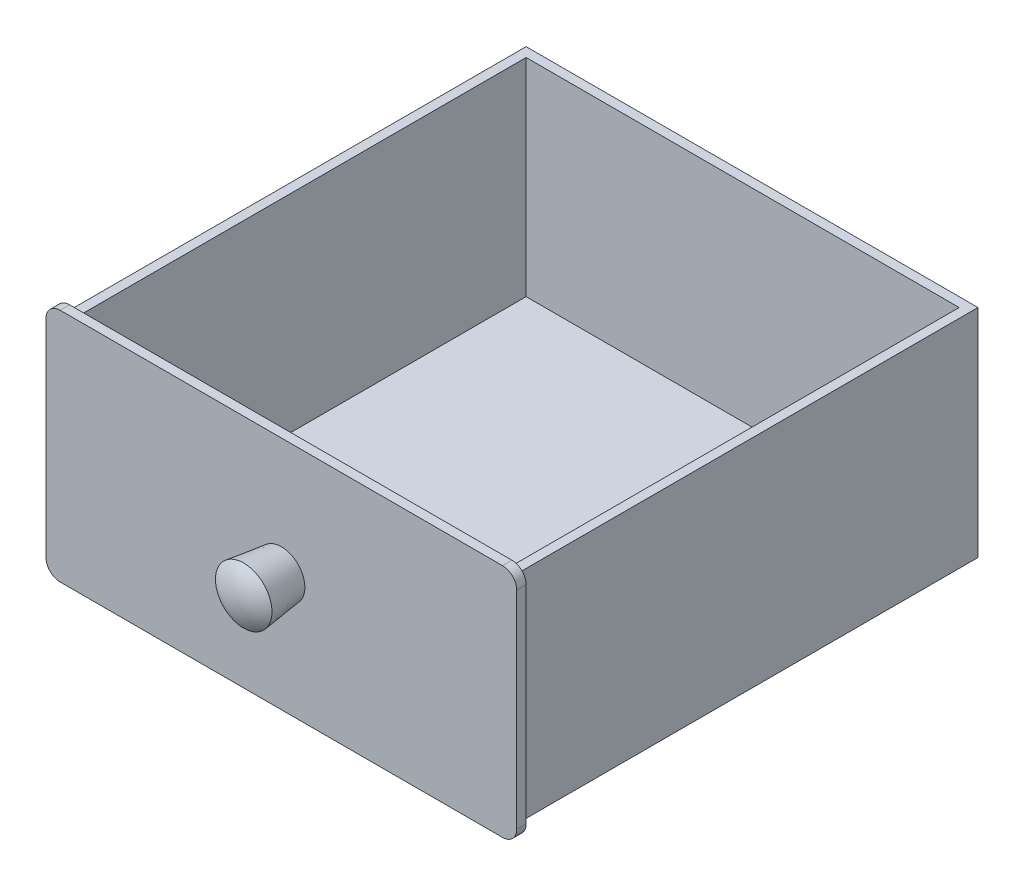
ISO-10303-21;
HEADER;
FILE_DESCRIPTION(('STEP AP214'),'2;1');
FILE_NAME('part.step','',(''),(''),'','','');
FILE_SCHEMA(('AUTOMOTIVE_DESIGN { 1 0 10303 214 1 1 1 1 }'));
ENDSEC;
DATA;
#1=APPLICATION_CONTEXT('core data for automotive mechanical design processes');
#2=APPLICATION_PROTOCOL_DEFINITION('international standard','automotive_design',2000,#1);
#3=PRODUCT_CONTEXT('',#1,'mechanical');
#4=PRODUCT('Part','Part','',(#3));
#5=PRODUCT_RELATED_PRODUCT_CATEGORY('part','',(#4));
#6=PRODUCT_DEFINITION_FORMATION('','',#4);
#7=PRODUCT_DEFINITION_CONTEXT('part definition',#1,'design');
#8=PRODUCT_DEFINITION('design','',#6,#7);
#9=PRODUCT_DEFINITION_SHAPE('','',#8);
#10=(LENGTH_UNIT() NAMED_UNIT(*) SI_UNIT(.MILLI.,.METRE.));
#11=(NAMED_UNIT(*) PLANE_ANGLE_UNIT() SI_UNIT($,.RADIAN.));
#12=(NAMED_UNIT(*) SI_UNIT($,.STERADIAN.) SOLID_ANGLE_UNIT());
#13=UNCERTAINTY_MEASURE_WITH_UNIT(LENGTH_MEASURE(1.E-05),#10,'distance_accuracy_value','');
#14=(GEOMETRIC_REPRESENTATION_CONTEXT(3) GLOBAL_UNCERTAINTY_ASSIGNED_CONTEXT((#13)) GLOBAL_UNIT_ASSIGNED_CONTEXT((#10,
#11,#12)) REPRESENTATION_CONTEXT('',''));
#15=CARTESIAN_POINT('',(0.,0.,0.));
#16=DIRECTION('',(0.,0.,1.));
#17=DIRECTION('',(1.,0.,0.));
#18=AXIS2_PLACEMENT_3D('',#15,#16,#17);
#19=CARTESIAN_POINT('',(0.,46.,0.));
#20=DIRECTION('',(0.,-1.,0.));
#21=DIRECTION('',(0.,0.,-1.));
#22=AXIS2_PLACEMENT_3D('',#19,#20,#21);
#23=PLANE('',#22);
#24=DIRECTION('',(0.,0.,-1.));
#25=VECTOR('',#24,1.);
#26=CARTESIAN_POINT('',(46.,46.,0.));
#27=LINE('',#26,#25);
#28=CARTESIAN_POINT('',(46.,46.,49.));
#29=VERTEX_POINT('',#28);
#30=CARTESIAN_POINT('',(46.,46.,-47.));
#31=VERTEX_POINT('',#30);
#32=EDGE_CURVE('E158',#29,#31,#27,.T.);
#33=ORIENTED_EDGE('',*,*,#32,.F.);
#34=DIRECTION('',(1.,0.,0.));
#35=VECTOR('',#34,1.);
#36=CARTESIAN_POINT('',(-48.,46.,49.));
#37=LINE('',#36,#35);
#38=CARTESIAN_POINT('',(48.,46.,49.));
#39=VERTEX_POINT('',#38);
#40=EDGE_CURVE('E188',#29,#39,#37,.T.);
#41=ORIENTED_EDGE('',*,*,#40,.T.);
#42=DIRECTION('',(0.,0.,-1.));
#43=VECTOR('',#42,1.);
#44=CARTESIAN_POINT('',(48.,46.,49.));
#45=LINE('',#44,#43);
#46=CARTESIAN_POINT('',(48.,46.,-49.));
#47=VERTEX_POINT('',#46);
#48=EDGE_CURVE('E179',#39,#47,#45,.T.);
#49=ORIENTED_EDGE('',*,*,#48,.T.);
#50=DIRECTION('',(-1.,0.,0.));
#51=VECTOR('',#50,1.);
#52=CARTESIAN_POINT('',(-48.,46.,-49.));
#53=LINE('',#52,#51);
#54=CARTESIAN_POINT('',(-48.,46.,-49.));
#55=VERTEX_POINT('',#54);
#56=EDGE_CURVE('E182',#47,#55,#53,.T.);
#57=ORIENTED_EDGE('',*,*,#56,.T.);
#58=DIRECTION('',(0.,0.,1.));
#59=VECTOR('',#58,1.);
#60=CARTESIAN_POINT('',(-48.,46.,49.));
#61=LINE('',#60,#59);
#62=CARTESIAN_POINT('',(-48.,46.,49.));
#63=VERTEX_POINT('',#62);
#64=EDGE_CURVE('E185',#55,#63,#61,.T.);
#65=ORIENTED_EDGE('',*,*,#64,.T.);
#66=CARTESIAN_POINT('',(-46.,46.,49.));
#67=VERTEX_POINT('',#66);
#68=EDGE_CURVE('E189',#63,#67,#37,.T.);
#69=ORIENTED_EDGE('',*,*,#68,.T.);
#70=DIRECTION('',(0.,0.,1.));
#71=VECTOR('',#70,1.);
#72=CARTESIAN_POINT('',(-46.,46.,0.));
#73=LINE('',#72,#71);
#74=CARTESIAN_POINT('',(-46.,46.,-47.));
#75=VERTEX_POINT('',#74);
#76=EDGE_CURVE('E169',#75,#67,#73,.T.);
#77=ORIENTED_EDGE('',*,*,#76,.F.);
#78=DIRECTION('',(-1.,0.,0.));
#79=VECTOR('',#78,1.);
#80=CARTESIAN_POINT('',(0.,46.,-47.));
#81=LINE('',#80,#79);
#82=EDGE_CURVE('E277',#31,#75,#81,.T.);
#83=ORIENTED_EDGE('',*,*,#82,.F.);
#84=EDGE_LOOP('',(#33,#41,#49,#57,#65,#69,#77,#83));
#85=FACE_BOUND('',#84,.T.);
#86=ADVANCED_FACE('F32',(#85),#23,.F.);
#87=CARTESIAN_POINT('',(48.,46.,49.));
#88=DIRECTION('',(-1.,0.,0.));
#89=DIRECTION('',(0.,0.,1.));
#90=AXIS2_PLACEMENT_3D('',#87,#88,#89);
#91=PLANE('',#90);
#92=DIRECTION('',(0.,0.,-1.));
#93=VECTOR('',#92,1.);
#94=CARTESIAN_POINT('',(48.,0.,49.));
#95=LINE('',#94,#93);
#96=CARTESIAN_POINT('',(48.,0.,49.));
#97=VERTEX_POINT('',#96);
#98=CARTESIAN_POINT('',(48.,0.,-49.));
#99=VERTEX_POINT('',#98);
#100=EDGE_CURVE('E192',#97,#99,#95,.T.);
#101=ORIENTED_EDGE('',*,*,#100,.T.);
#102=DIRECTION('',(0.,-1.,0.));
#103=VECTOR('',#102,1.);
#104=CARTESIAN_POINT('',(48.,46.,-49.));
#105=LINE('',#104,#103);
#106=EDGE_CURVE('E208',#47,#99,#105,.T.);
#107=ORIENTED_EDGE('',*,*,#106,.F.);
#108=ORIENTED_EDGE('',*,*,#48,.F.);
#109=DIRECTION('',(0.,-1.,0.));
#110=VECTOR('',#109,1.);
#111=CARTESIAN_POINT('',(48.,46.,49.));
#112=LINE('',#111,#110);
#113=EDGE_CURVE('E191',#39,#97,#112,.T.);
#114=ORIENTED_EDGE('',*,*,#113,.T.);
#115=EDGE_LOOP('',(#101,#107,#108,#114));
#116=FACE_BOUND('',#115,.T.);
#117=ADVANCED_FACE('F297',(#116),#91,.F.);
#118=CARTESIAN_POINT('',(-48.,46.,-49.));
#119=DIRECTION('',(0.,0.,1.));
#120=DIRECTION('',(1.,0.,0.));
#121=AXIS2_PLACEMENT_3D('',#118,#119,#120);
#122=PLANE('',#121);
#123=DIRECTION('',(-1.,0.,0.));
#124=VECTOR('',#123,1.);
#125=CARTESIAN_POINT('',(-48.,0.,-49.));
#126=LINE('',#125,#124);
#127=CARTESIAN_POINT('',(-48.,0.,-49.));
#128=VERTEX_POINT('',#127);
#129=EDGE_CURVE('E195',#99,#128,#126,.T.);
#130=ORIENTED_EDGE('',*,*,#129,.T.);
#131=DIRECTION('',(0.,-1.,0.));
#132=VECTOR('',#131,1.);
#133=CARTESIAN_POINT('',(-48.,46.,-49.));
#134=LINE('',#133,#132);
#135=EDGE_CURVE('E205',#55,#128,#134,.T.);
#136=ORIENTED_EDGE('',*,*,#135,.F.);
#137=ORIENTED_EDGE('',*,*,#56,.F.);
#138=ORIENTED_EDGE('',*,*,#106,.T.);
#139=EDGE_LOOP('',(#130,#136,#137,#138));
#140=FACE_BOUND('',#139,.T.);
#141=ADVANCED_FACE('F316',(#140),#122,.F.);
#142=CARTESIAN_POINT('',(-48.,46.,49.));
#143=DIRECTION('',(1.,0.,0.));
#144=DIRECTION('',(0.,0.,-1.));
#145=AXIS2_PLACEMENT_3D('',#142,#143,#144);
#146=PLANE('',#145);
#147=DIRECTION('',(0.,0.,1.));
#148=VECTOR('',#147,1.);
#149=CARTESIAN_POINT('',(-48.,0.,49.));
#150=LINE('',#149,#148);
#151=CARTESIAN_POINT('',(-48.,0.,49.));
#152=VERTEX_POINT('',#151);
#153=EDGE_CURVE('E197',#128,#152,#150,.T.);
#154=ORIENTED_EDGE('',*,*,#153,.T.);
#155=DIRECTION('',(0.,-1.,0.));
#156=VECTOR('',#155,1.);
#157=CARTESIAN_POINT('',(-48.,46.,49.));
#158=LINE('',#157,#156);
#159=EDGE_CURVE('E203',#63,#152,#158,.T.);
#160=ORIENTED_EDGE('',*,*,#159,.F.);
#161=ORIENTED_EDGE('',*,*,#64,.F.);
#162=ORIENTED_EDGE('',*,*,#135,.T.);
#163=EDGE_LOOP('',(#154,#160,#161,#162));
#164=FACE_BOUND('',#163,.T.);
#165=ADVANCED_FACE('F290',(#164),#146,.F.);
#166=CARTESIAN_POINT('',(0.,0.,0.));
#167=DIRECTION('',(0.,-1.,0.));
#168=DIRECTION('',(0.,0.,-1.));
#169=AXIS2_PLACEMENT_3D('',#166,#167,#168);
#170=PLANE('',#169);
#171=ORIENTED_EDGE('',*,*,#100,.F.);
#172=DIRECTION('',(1.,0.,0.));
#173=VECTOR('',#172,1.);
#174=CARTESIAN_POINT('',(-48.,0.,49.));
#175=LINE('',#174,#173);
#176=EDGE_CURVE('E183',#152,#97,#175,.T.);
#177=ORIENTED_EDGE('',*,*,#176,.F.);
#178=ORIENTED_EDGE('',*,*,#153,.F.);
#179=ORIENTED_EDGE('',*,*,#129,.F.);
#180=EDGE_LOOP('',(#171,#177,#178,#179));
#181=FACE_BOUND('',#180,.T.);
#182=ADVANCED_FACE('F294',(#181),#170,.T.);
#183=CARTESIAN_POINT('',(46.,46.,49.));
#184=DIRECTION('',(-1.,0.,0.));
#185=DIRECTION('',(0.,0.,1.));
#186=AXIS2_PLACEMENT_3D('',#183,#184,#185);
#187=PLANE('',#186);
#188=DIRECTION('',(0.,0.,-1.));
#189=VECTOR('',#188,1.);
#190=CARTESIAN_POINT('',(46.,2.,0.));
#191=LINE('',#190,#189);
#192=CARTESIAN_POINT('',(46.,2.,49.));
#193=VERTEX_POINT('',#192);
#194=CARTESIAN_POINT('',(46.,2.,-47.));
#195=VERTEX_POINT('',#194);
#196=EDGE_CURVE('E272',#193,#195,#191,.T.);
#197=ORIENTED_EDGE('',*,*,#196,.F.);
#198=DIRECTION('',(0.,-1.,0.));
#199=VECTOR('',#198,1.);
#200=CARTESIAN_POINT('',(46.,46.,49.));
#201=LINE('',#200,#199);
#202=EDGE_CURVE('E154',#29,#193,#201,.T.);
#203=ORIENTED_EDGE('',*,*,#202,.F.);
#204=ORIENTED_EDGE('',*,*,#32,.T.);
#205=DIRECTION('',(0.,-1.,0.));
#206=VECTOR('',#205,1.);
#207=CARTESIAN_POINT('',(46.,46.,-47.));
#208=LINE('',#207,#206);
#209=EDGE_CURVE('E173',#31,#195,#208,.T.);
#210=ORIENTED_EDGE('',*,*,#209,.T.);
#211=EDGE_LOOP('',(#197,#203,#204,#210));
#212=FACE_BOUND('',#211,.T.);
#213=ADVANCED_FACE('F301',(#212),#187,.T.);
#214=CARTESIAN_POINT('',(-48.,46.,-47.));
#215=DIRECTION('',(0.,0.,1.));
#216=DIRECTION('',(1.,0.,0.));
#217=AXIS2_PLACEMENT_3D('',#214,#215,#216);
#218=PLANE('',#217);
#219=DIRECTION('',(-1.,0.,0.));
#220=VECTOR('',#219,1.);
#221=CARTESIAN_POINT('',(0.,2.,-47.));
#222=LINE('',#221,#220);
#223=CARTESIAN_POINT('',(-46.,2.,-47.));
#224=VERTEX_POINT('',#223);
#225=EDGE_CURVE('E163',#195,#224,#222,.T.);
#226=ORIENTED_EDGE('',*,*,#225,.F.);
#227=ORIENTED_EDGE('',*,*,#209,.F.);
#228=ORIENTED_EDGE('',*,*,#82,.T.);
#229=DIRECTION('',(0.,-1.,0.));
#230=VECTOR('',#229,1.);
#231=CARTESIAN_POINT('',(-46.,46.,-47.));
#232=LINE('',#231,#230);
#233=EDGE_CURVE('E171',#75,#224,#232,.T.);
#234=ORIENTED_EDGE('',*,*,#233,.T.);
#235=EDGE_LOOP('',(#226,#227,#228,#234));
#236=FACE_BOUND('',#235,.T.);
#237=ADVANCED_FACE('F282',(#236),#218,.T.);
#238=CARTESIAN_POINT('',(-46.,46.,49.));
#239=DIRECTION('',(1.,0.,0.));
#240=DIRECTION('',(0.,0.,-1.));
#241=AXIS2_PLACEMENT_3D('',#238,#239,#240);
#242=PLANE('',#241);
#243=DIRECTION('',(0.,0.,1.));
#244=VECTOR('',#243,1.);
#245=CARTESIAN_POINT('',(-46.,2.,0.));
#246=LINE('',#245,#244);
#247=CARTESIAN_POINT('',(-46.,2.,49.));
#248=VERTEX_POINT('',#247);
#249=EDGE_CURVE('E159',#224,#248,#246,.T.);
#250=ORIENTED_EDGE('',*,*,#249,.F.);
#251=ORIENTED_EDGE('',*,*,#233,.F.);
#252=ORIENTED_EDGE('',*,*,#76,.T.);
#253=DIRECTION('',(0.,-1.,0.));
#254=VECTOR('',#253,1.);
#255=CARTESIAN_POINT('',(-46.,46.,49.));
#256=LINE('',#255,#254);
#257=EDGE_CURVE('E151',#67,#248,#256,.T.);
#258=ORIENTED_EDGE('',*,*,#257,.T.);
#259=EDGE_LOOP('',(#250,#251,#252,#258));
#260=FACE_BOUND('',#259,.T.);
#261=ADVANCED_FACE('F167',(#260),#242,.T.);
#262=CARTESIAN_POINT('',(0.,2.,0.));
#263=DIRECTION('',(0.,-1.,0.));
#264=DIRECTION('',(0.,0.,-1.));
#265=AXIS2_PLACEMENT_3D('',#262,#263,#264);
#266=PLANE('',#265);
#267=ORIENTED_EDGE('',*,*,#196,.T.);
#268=ORIENTED_EDGE('',*,*,#225,.T.);
#269=ORIENTED_EDGE('',*,*,#249,.T.);
#270=DIRECTION('',(1.,0.,0.));
#271=VECTOR('',#270,1.);
#272=CARTESIAN_POINT('',(0.,2.,49.));
#273=LINE('',#272,#271);
#274=EDGE_CURVE('E146',#248,#193,#273,.T.);
#275=ORIENTED_EDGE('',*,*,#274,.T.);
#276=EDGE_LOOP('',(#267,#268,#269,#275));
#277=FACE_BOUND('',#276,.T.);
#278=ADVANCED_FACE('F162',(#277),#266,.F.);
#279=CARTESIAN_POINT('',(-50.,48.,51.));
#280=DIRECTION('',(1.,0.,0.));
#281=DIRECTION('',(0.,1.,0.));
#282=AXIS2_PLACEMENT_3D('',#279,#280,#281);
#283=PLANE('',#282);
#284=DIRECTION('',(0.,-1.,0.));
#285=VECTOR('',#284,1.);
#286=CARTESIAN_POINT('',(-50.,48.,49.));
#287=LINE('',#286,#285);
#288=CARTESIAN_POINT('',(-50.,45.,49.));
#289=VERTEX_POINT('',#288);
#290=CARTESIAN_POINT('',(-50.,1.,49.));
#291=VERTEX_POINT('',#290);
#292=EDGE_CURVE('E346',#289,#291,#287,.T.);
#293=ORIENTED_EDGE('',*,*,#292,.T.);
#294=DIRECTION('',(0.,0.,-1.));
#295=VECTOR('',#294,1.);
#296=CARTESIAN_POINT('',(-50.,1.,51.));
#297=LINE('',#296,#295);
#298=CARTESIAN_POINT('',(-50.,1.,51.));
#299=VERTEX_POINT('',#298);
#300=EDGE_CURVE('E230',#291,#299,#297,.F.);
#301=ORIENTED_EDGE('',*,*,#300,.T.);
#302=DIRECTION('',(0.,-1.,0.));
#303=VECTOR('',#302,1.);
#304=CARTESIAN_POINT('',(-50.,48.,51.));
#305=LINE('',#304,#303);
#306=CARTESIAN_POINT('',(-50.,45.,51.));
#307=VERTEX_POINT('',#306);
#308=EDGE_CURVE('E265',#307,#299,#305,.T.);
#309=ORIENTED_EDGE('',*,*,#308,.F.);
#310=DIRECTION('',(0.,0.,-1.));
#311=VECTOR('',#310,1.);
#312=CARTESIAN_POINT('',(-50.,45.,51.));
#313=LINE('',#312,#311);
#314=EDGE_CURVE('E227',#307,#289,#313,.T.);
#315=ORIENTED_EDGE('',*,*,#314,.T.);
#316=EDGE_LOOP('',(#293,#301,#309,#315));
#317=FACE_BOUND('',#316,.T.);
#318=ADVANCED_FACE('F376',(#317),#283,.F.);
#319=CARTESIAN_POINT('',(-50.,-2.,51.));
#320=DIRECTION('',(0.,1.,0.));
#321=DIRECTION('',(-1.,0.,0.));
#322=AXIS2_PLACEMENT_3D('',#319,#320,#321);
#323=PLANE('',#322);
#324=DIRECTION('',(1.,0.,0.));
#325=VECTOR('',#324,1.);
#326=CARTESIAN_POINT('',(-50.,-2.,51.));
#327=LINE('',#326,#325);
#328=CARTESIAN_POINT('',(-47.,-2.,51.));
#329=VERTEX_POINT('',#328);
#330=CARTESIAN_POINT('',(47.,-2.,51.));
#331=VERTEX_POINT('',#330);
#332=EDGE_CURVE('E257',#329,#331,#327,.T.);
#333=ORIENTED_EDGE('',*,*,#332,.F.);
#334=DIRECTION('',(0.,0.,-1.));
#335=VECTOR('',#334,1.);
#336=CARTESIAN_POINT('',(-47.,-2.,51.));
#337=LINE('',#336,#335);
#338=CARTESIAN_POINT('',(-47.,-2.,49.));
#339=VERTEX_POINT('',#338);
#340=EDGE_CURVE('E216',#329,#339,#337,.T.);
#341=ORIENTED_EDGE('',*,*,#340,.T.);
#342=DIRECTION('',(1.,0.,0.));
#343=VECTOR('',#342,1.);
#344=CARTESIAN_POINT('',(-50.,-2.,49.));
#345=LINE('',#344,#343);
#346=CARTESIAN_POINT('',(47.,-2.,49.));
#347=VERTEX_POINT('',#346);
#348=EDGE_CURVE('E268',#339,#347,#345,.T.);
#349=ORIENTED_EDGE('',*,*,#348,.T.);
#350=DIRECTION('',(0.,0.,-1.));
#351=VECTOR('',#350,1.);
#352=CARTESIAN_POINT('',(47.,-2.,51.));
#353=LINE('',#352,#351);
#354=EDGE_CURVE('E214',#347,#331,#353,.F.);
#355=ORIENTED_EDGE('',*,*,#354,.T.);
#356=EDGE_LOOP('',(#333,#341,#349,#355));
#357=FACE_BOUND('',#356,.T.);
#358=ADVANCED_FACE('F344',(#357),#323,.F.);
#359=CARTESIAN_POINT('',(50.,48.,51.));
#360=DIRECTION('',(-1.,0.,0.));
#361=DIRECTION('',(0.,-1.,0.));
#362=AXIS2_PLACEMENT_3D('',#359,#360,#361);
#363=PLANE('',#362);
#364=DIRECTION('',(0.,1.,0.));
#365=VECTOR('',#364,1.);
#366=CARTESIAN_POINT('',(50.,48.,51.));
#367=LINE('',#366,#365);
#368=CARTESIAN_POINT('',(50.,1.,51.));
#369=VERTEX_POINT('',#368);
#370=CARTESIAN_POINT('',(50.,45.,51.));
#371=VERTEX_POINT('',#370);
#372=EDGE_CURVE('E247',#369,#371,#367,.T.);
#373=ORIENTED_EDGE('',*,*,#372,.F.);
#374=DIRECTION('',(0.,0.,-1.));
#375=VECTOR('',#374,1.);
#376=CARTESIAN_POINT('',(50.,1.,51.));
#377=LINE('',#376,#375);
#378=CARTESIAN_POINT('',(50.,1.,49.));
#379=VERTEX_POINT('',#378);
#380=EDGE_CURVE('E11',#369,#379,#377,.T.);
#381=ORIENTED_EDGE('',*,*,#380,.T.);
#382=DIRECTION('',(0.,1.,0.));
#383=VECTOR('',#382,1.);
#384=CARTESIAN_POINT('',(50.,48.,49.));
#385=LINE('',#384,#383);
#386=CARTESIAN_POINT('',(50.,45.,49.));
#387=VERTEX_POINT('',#386);
#388=EDGE_CURVE('E250',#379,#387,#385,.T.);
#389=ORIENTED_EDGE('',*,*,#388,.T.);
#390=DIRECTION('',(0.,0.,-1.));
#391=VECTOR('',#390,1.);
#392=CARTESIAN_POINT('',(50.,45.,51.));
#393=LINE('',#392,#391);
#394=EDGE_CURVE('E40',#387,#371,#393,.F.);
#395=ORIENTED_EDGE('',*,*,#394,.T.);
#396=EDGE_LOOP('',(#373,#381,#389,#395));
#397=FACE_BOUND('',#396,.T.);
#398=ADVANCED_FACE('F246',(#397),#363,.F.);
#399=CARTESIAN_POINT('',(-50.,48.,51.));
#400=DIRECTION('',(0.,-1.,0.));
#401=DIRECTION('',(0.,0.,-1.));
#402=AXIS2_PLACEMENT_3D('',#399,#400,#401);
#403=PLANE('',#402);
#404=DIRECTION('',(-1.,0.,0.));
#405=VECTOR('',#404,1.);
#406=CARTESIAN_POINT('',(-50.,48.,49.));
#407=LINE('',#406,#405);
#408=CARTESIAN_POINT('',(47.,48.,49.));
#409=VERTEX_POINT('',#408);
#410=CARTESIAN_POINT('',(-47.,48.,49.));
#411=VERTEX_POINT('',#410);
#412=EDGE_CURVE('E262',#409,#411,#407,.T.);
#413=ORIENTED_EDGE('',*,*,#412,.T.);
#414=DIRECTION('',(0.,0.,-1.));
#415=VECTOR('',#414,1.);
#416=CARTESIAN_POINT('',(-47.,48.,51.));
#417=LINE('',#416,#415);
#418=CARTESIAN_POINT('',(-47.,48.,51.));
#419=VERTEX_POINT('',#418);
#420=EDGE_CURVE('E47',#411,#419,#417,.F.);
#421=ORIENTED_EDGE('',*,*,#420,.T.);
#422=DIRECTION('',(-1.,0.,0.));
#423=VECTOR('',#422,1.);
#424=CARTESIAN_POINT('',(-50.,48.,51.));
#425=LINE('',#424,#423);
#426=CARTESIAN_POINT('',(47.,48.,51.));
#427=VERTEX_POINT('',#426);
#428=EDGE_CURVE('E256',#427,#419,#425,.T.);
#429=ORIENTED_EDGE('',*,*,#428,.F.);
#430=DIRECTION('',(0.,0.,-1.));
#431=VECTOR('',#430,1.);
#432=CARTESIAN_POINT('',(47.,48.,51.));
#433=LINE('',#432,#431);
#434=EDGE_CURVE('E239',#427,#409,#433,.T.);
#435=ORIENTED_EDGE('',*,*,#434,.T.);
#436=EDGE_LOOP('',(#413,#421,#429,#435));
#437=FACE_BOUND('',#436,.T.);
#438=ADVANCED_FACE('F261',(#437),#403,.F.);
#439=CARTESIAN_POINT('',(0.,0.,51.));
#440=DIRECTION('',(0.,0.,1.));
#441=DIRECTION('',(1.,0.,0.));
#442=AXIS2_PLACEMENT_3D('',#439,#440,#441);
#443=PLANE('',#442);
#444=CARTESIAN_POINT('',(0.,23.,51.));
#445=DIRECTION('',(0.,0.,1.));
#446=DIRECTION('',(1.,0.,0.));
#447=AXIS2_PLACEMENT_3D('',#444,#445,#446);
#448=CIRCLE('',#447,5.);
#449=CARTESIAN_POINT('',(5.,23.,51.));
#450=VERTEX_POINT('',#449);
#451=EDGE_CURVE('E211',#450,#450,#448,.T.);
#452=ORIENTED_EDGE('',*,*,#451,.F.);
#453=EDGE_LOOP('',(#452));
#454=FACE_BOUND('',#453,.T.);
#455=ORIENTED_EDGE('',*,*,#308,.T.);
#456=CARTESIAN_POINT('',(-47.,1.,51.));
#457=DIRECTION('',(0.,0.,1.));
#458=DIRECTION('',(1.,0.,0.));
#459=AXIS2_PLACEMENT_3D('',#456,#457,#458);
#460=CIRCLE('',#459,3.);
#461=EDGE_CURVE('E237',#299,#329,#460,.T.);
#462=ORIENTED_EDGE('',*,*,#461,.T.);
#463=ORIENTED_EDGE('',*,*,#332,.T.);
#464=CARTESIAN_POINT('',(47.,1.,51.));
#465=DIRECTION('',(0.,0.,1.));
#466=DIRECTION('',(1.,0.,0.));
#467=AXIS2_PLACEMENT_3D('',#464,#465,#466);
#468=CIRCLE('',#467,3.);
#469=EDGE_CURVE('E233',#331,#369,#468,.T.);
#470=ORIENTED_EDGE('',*,*,#469,.T.);
#471=ORIENTED_EDGE('',*,*,#372,.T.);
#472=CARTESIAN_POINT('',(47.,45.,51.));
#473=DIRECTION('',(0.,0.,1.));
#474=DIRECTION('',(1.,0.,0.));
#475=AXIS2_PLACEMENT_3D('',#472,#473,#474);
#476=CIRCLE('',#475,3.);
#477=EDGE_CURVE('E54',#371,#427,#476,.T.);
#478=ORIENTED_EDGE('',*,*,#477,.T.);
#479=ORIENTED_EDGE('',*,*,#428,.T.);
#480=CARTESIAN_POINT('',(-47.,45.,51.));
#481=DIRECTION('',(0.,0.,1.));
#482=DIRECTION('',(1.,0.,0.));
#483=AXIS2_PLACEMENT_3D('',#480,#481,#482);
#484=CIRCLE('',#483,3.);
#485=EDGE_CURVE('E235',#419,#307,#484,.T.);
#486=ORIENTED_EDGE('',*,*,#485,.T.);
#487=EDGE_LOOP('',(#455,#462,#463,#470,#471,#478,#479,#486));
#488=FACE_BOUND('',#487,.T.);
#489=ADVANCED_FACE('F253',(#454,#488),#443,.T.);
#490=CARTESIAN_POINT('',(0.,0.,49.));
#491=DIRECTION('',(0.,0.,1.));
#492=DIRECTION('',(1.,0.,0.));
#493=AXIS2_PLACEMENT_3D('',#490,#491,#492);
#494=PLANE('',#493);
#495=ORIENTED_EDGE('',*,*,#176,.T.);
#496=ORIENTED_EDGE('',*,*,#113,.F.);
#497=ORIENTED_EDGE('',*,*,#40,.F.);
#498=ORIENTED_EDGE('',*,*,#202,.T.);
#499=ORIENTED_EDGE('',*,*,#274,.F.);
#500=ORIENTED_EDGE('',*,*,#257,.F.);
#501=ORIENTED_EDGE('',*,*,#68,.F.);
#502=ORIENTED_EDGE('',*,*,#159,.T.);
#503=EDGE_LOOP('',(#495,#496,#497,#498,#499,#500,#501,#502));
#504=FACE_BOUND('',#503,.T.);
#505=ORIENTED_EDGE('',*,*,#348,.F.);
#506=CARTESIAN_POINT('',(-47.,1.,49.));
#507=DIRECTION('',(0.,0.,1.));
#508=DIRECTION('',(1.,0.,0.));
#509=AXIS2_PLACEMENT_3D('',#506,#507,#508);
#510=CIRCLE('',#509,3.);
#511=EDGE_CURVE('E225',#339,#291,#510,.F.);
#512=ORIENTED_EDGE('',*,*,#511,.T.);
#513=ORIENTED_EDGE('',*,*,#292,.F.);
#514=CARTESIAN_POINT('',(-47.,45.,49.));
#515=DIRECTION('',(0.,0.,1.));
#516=DIRECTION('',(1.,0.,0.));
#517=AXIS2_PLACEMENT_3D('',#514,#515,#516);
#518=CIRCLE('',#517,3.);
#519=EDGE_CURVE('E223',#289,#411,#518,.F.);
#520=ORIENTED_EDGE('',*,*,#519,.T.);
#521=ORIENTED_EDGE('',*,*,#412,.F.);
#522=CARTESIAN_POINT('',(47.,45.,49.));
#523=DIRECTION('',(0.,0.,1.));
#524=DIRECTION('',(1.,0.,0.));
#525=AXIS2_PLACEMENT_3D('',#522,#523,#524);
#526=CIRCLE('',#525,3.);
#527=EDGE_CURVE('E219',#409,#387,#526,.F.);
#528=ORIENTED_EDGE('',*,*,#527,.T.);
#529=ORIENTED_EDGE('',*,*,#388,.F.);
#530=CARTESIAN_POINT('',(47.,1.,49.));
#531=DIRECTION('',(0.,0.,1.));
#532=DIRECTION('',(1.,0.,0.));
#533=AXIS2_PLACEMENT_3D('',#530,#531,#532);
#534=CIRCLE('',#533,3.);
#535=EDGE_CURVE('E221',#379,#347,#534,.F.);
#536=ORIENTED_EDGE('',*,*,#535,.T.);
#537=EDGE_LOOP('',(#505,#512,#513,#520,#521,#528,#529,#536));
#538=FACE_BOUND('',#537,.T.);
#539=ADVANCED_FACE('F148',(#504,#538),#494,.F.);
#540=CARTESIAN_POINT('',(0.,23.,51.));
#541=DIRECTION('',(0.,0.,-1.));
#542=DIRECTION('',(0.,1.,0.));
#543=AXIS2_PLACEMENT_3D('',#540,#541,#542);
#544=SPHERICAL_SURFACE('',#543,9.99999999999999);
#545=CARTESIAN_POINT('',(0.,23.,59.));
#546=DIRECTION('',(0.,0.,-1.));
#547=DIRECTION('',(-1.,0.,0.));
#548=AXIS2_PLACEMENT_3D('',#545,#546,#547);
#549=CIRCLE('',#548,5.99999999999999);
#550=CARTESIAN_POINT('',(-5.99999999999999,23.,59.));
#551=VERTEX_POINT('',#550);
#552=EDGE_CURVE('E348',#551,#551,#549,.T.);
#553=ORIENTED_EDGE('',*,*,#552,.F.);
#554=EDGE_LOOP('',(#553));
#555=FACE_BOUND('',#554,.T.);
#556=ADVANCED_FACE('F358',(#555),#544,.T.);
#557=CARTESIAN_POINT('',(0.,23.,51.));
#558=DIRECTION('',(0.,0.,1.));
#559=DIRECTION('',(1.,0.,0.));
#560=AXIS2_PLACEMENT_3D('',#557,#558,#559);
#561=CONICAL_SURFACE('',#560,5.,0.12435499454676);
#562=ORIENTED_EDGE('',*,*,#552,.T.);
#563=EDGE_LOOP('',(#562));
#564=FACE_BOUND('',#563,.T.);
#565=ORIENTED_EDGE('',*,*,#451,.T.);
#566=EDGE_LOOP('',(#565));
#567=FACE_BOUND('',#566,.T.);
#568=ADVANCED_FACE('F330',(#564,#567),#561,.T.);
#569=CARTESIAN_POINT('',(-47.,1.,51.));
#570=DIRECTION('',(0.,0.,-1.));
#571=DIRECTION('',(-1.,0.,0.));
#572=AXIS2_PLACEMENT_3D('',#569,#570,#571);
#573=CYLINDRICAL_SURFACE('',#572,3.);
#574=ORIENTED_EDGE('',*,*,#461,.F.);
#575=ORIENTED_EDGE('',*,*,#300,.F.);
#576=ORIENTED_EDGE('',*,*,#511,.F.);
#577=ORIENTED_EDGE('',*,*,#340,.F.);
#578=EDGE_LOOP('',(#574,#575,#576,#577));
#579=FACE_BOUND('',#578,.T.);
#580=ADVANCED_FACE('F326',(#579),#573,.T.);
#581=CARTESIAN_POINT('',(-47.,45.,51.));
#582=DIRECTION('',(0.,0.,-1.));
#583=DIRECTION('',(-1.,0.,0.));
#584=AXIS2_PLACEMENT_3D('',#581,#582,#583);
#585=CYLINDRICAL_SURFACE('',#584,3.);
#586=ORIENTED_EDGE('',*,*,#485,.F.);
#587=ORIENTED_EDGE('',*,*,#420,.F.);
#588=ORIENTED_EDGE('',*,*,#519,.F.);
#589=ORIENTED_EDGE('',*,*,#314,.F.);
#590=EDGE_LOOP('',(#586,#587,#588,#589));
#591=FACE_BOUND('',#590,.T.);
#592=ADVANCED_FACE('F329',(#591),#585,.T.);
#593=CARTESIAN_POINT('',(47.,1.,51.));
#594=DIRECTION('',(0.,0.,-1.));
#595=DIRECTION('',(-1.,0.,0.));
#596=AXIS2_PLACEMENT_3D('',#593,#594,#595);
#597=CYLINDRICAL_SURFACE('',#596,3.);
#598=ORIENTED_EDGE('',*,*,#469,.F.);
#599=ORIENTED_EDGE('',*,*,#354,.F.);
#600=ORIENTED_EDGE('',*,*,#535,.F.);
#601=ORIENTED_EDGE('',*,*,#380,.F.);
#602=EDGE_LOOP('',(#598,#599,#600,#601));
#603=FACE_BOUND('',#602,.T.);
#604=ADVANCED_FACE('F333',(#603),#597,.T.);
#605=CARTESIAN_POINT('',(47.,45.,51.));
#606=DIRECTION('',(0.,0.,-1.));
#607=DIRECTION('',(-1.,0.,0.));
#608=AXIS2_PLACEMENT_3D('',#605,#606,#607);
#609=CYLINDRICAL_SURFACE('',#608,3.);
#610=ORIENTED_EDGE('',*,*,#477,.F.);
#611=ORIENTED_EDGE('',*,*,#394,.F.);
#612=ORIENTED_EDGE('',*,*,#527,.F.);
#613=ORIENTED_EDGE('',*,*,#434,.F.);
#614=EDGE_LOOP('',(#610,#611,#612,#613));
#615=FACE_BOUND('',#614,.T.);
#616=ADVANCED_FACE('F34',(#615),#609,.T.);
#617=CLOSED_SHELL('',(#86,#117,#141,#165,#182,#213,#237,#261,#278,#318,#358,#398,#438,#489,#539,
#556,#568,#580,#592,#604,#616));
#618=MANIFOLD_SOLID_BREP('B2',#617);
#619=ADVANCED_BREP_SHAPE_REPRESENTATION('',(#18,#618),#14);
#620=SHAPE_DEFINITION_REPRESENTATION(#9,#619);
ENDSEC;
END-ISO-10303-21;
